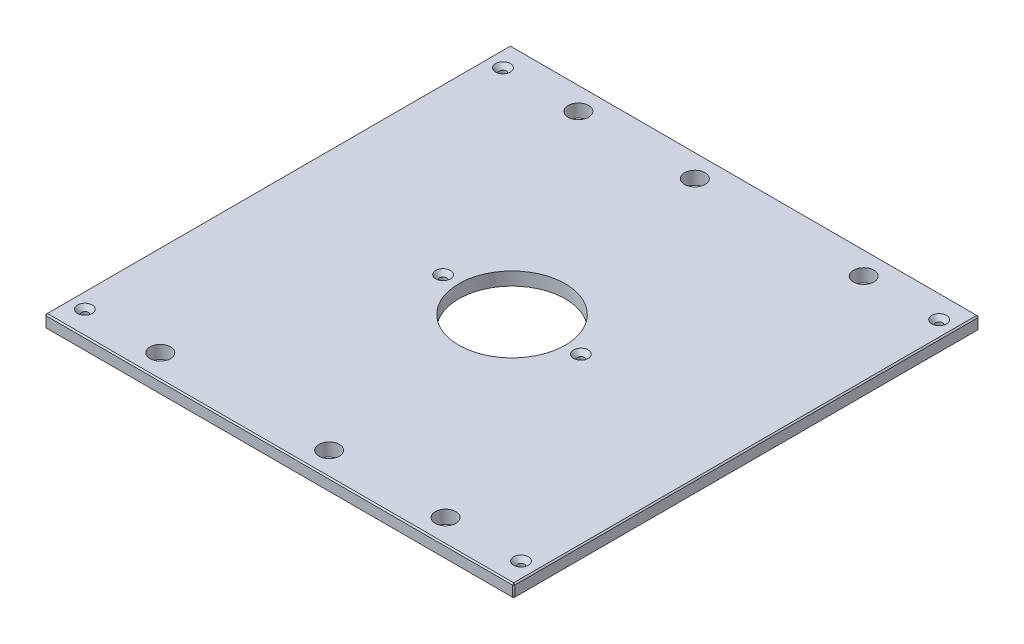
from build123d import *

# Parameters (mm, degrees)
SKETCH1_W                                        = 454.025
SKETCH1_H                                        = 450.85
BOSS_EXTRUDE1_DEPTH                              = 12.7
SKETCH13_R                                       = 51.562
CUT_EXTRUDE6_DEPTH                               = 321.175570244
F_25_32_0_78125_DIAMETER_HOLE1_D                 = 19.84375
CHAMFER2_SIZE                                    = 1.27
CSK_FOR_1_4_FLAT_HEAD_MACHINE_SCREW1_D           = 6.7564
CSK_FOR_1_4_FLAT_HEAD_MACHINE_SCREW1_CSINK_D     = 14.2748
CSK_FOR_1_4_FLAT_HEAD_MACHINE_SCREW1_CSINK_ANGLE = 82


with BuildPart() as part:
    # Sketch1 → Boss-Extrude1 (new body)
    with BuildSketch(Plane(origin=(0, 0, 0), x_dir=(1, 0, 0), z_dir=(0, 1, 0))):
        Rectangle(SKETCH1_W, SKETCH1_H)
    extrude(amount=BOSS_EXTRUDE1_DEPTH)

    # Sketch13 → Cut-Extrude6 (cut, through all)
    with BuildSketch(Plane(origin=(0, 12.7, 0), x_dir=(1, 0, 0), z_dir=(0, 1, 0))):
        with Locations(Location((0, 0, 0), (0, 0, 270))):
            Circle(SKETCH13_R)
    extrude(amount=-CUT_EXTRUDE6_DEPTH, mode=Mode.SUBTRACT)

    # 25_32 _0.78125_ Diameter Hole1 (through all)
    with Locations(Plane(origin=(0, 12.7, 0), x_dir=(1, 0, 0), z_dir=(0, 1, 0))):
        with Locations((138.1125, 202.40498), (-138.1125, 202.40498), (138.1125, -202.40498), (-138.1125, -202.40498), (-25.4, 202.40498), (25.4, -202.40498)):
            Hole(F_25_32_0_78125_DIAMETER_HOLE1_D / 2)

    # Chamfer2
    chamfer2_edges = [part.edges().sort_by_distance(p)[0] for p in [
        (227.0125, 12.7, 0),
        (0, 12.7, -225.425),
        (-227.0125, 12.7, 0),
        (0, 0, -225.425),
        (227.0125, 0, 0),
        (0, 0, 225.425),
        (-227.0125, 0, 0),
        (0, 12.7, 225.425),
        (-227.0125, 6.35, -225.425),
        (227.0125, 6.35, -225.425),
        (227.0125, 6.35, 225.425),
        (-227.0125, 6.35, 225.425),
    ]]
    chamfer(chamfer2_edges, length=CHAMFER2_SIZE)

    # CSK for 1_4 Flat Head Machine Screw1 (through all)
    with Locations(Plane(origin=(0, 12.7, 0), x_dir=(1, 0, 0), z_dir=(0, 1, 0))):
        with Locations((211.1375, 202.40498), (211.1375, -202.40498), (-211.1375, -202.40498), (-66.675, 0), (66.675, 0), (-211.1375, 202.40498), (-138.1125, 202.40498), (-138.1125, -202.40498)):
            CounterSinkHole(CSK_FOR_1_4_FLAT_HEAD_MACHINE_SCREW1_D / 2, CSK_FOR_1_4_FLAT_HEAD_MACHINE_SCREW1_CSINK_D / 2, counter_sink_angle=CSK_FOR_1_4_FLAT_HEAD_MACHINE_SCREW1_CSINK_ANGLE)


solid = part.part
